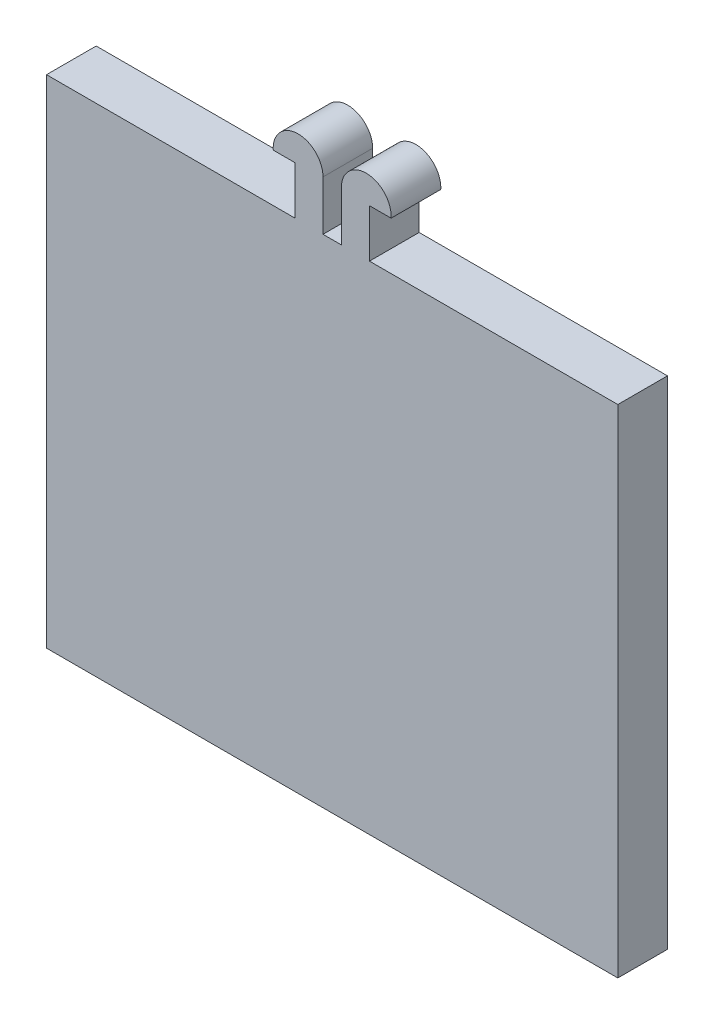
from build123d import *

# Parameters (mm, degrees)
BOSS_EXTRUDE1_DEPTH = 3


with BuildPart() as part:
    # Sketch1 → Boss-Extrude1 (new body)
    with BuildSketch(Plane.XY):
        with BuildLine():
            Line((17.254, -15), (-17.254, -15))
            Line((-17.254, -15), (-17.254, 15))
            Line((-17.254, 15), (-2.254, 15))
            Line((-2.254, 15), (-2.254, 17.9))
            Line((-2.254, 17.9), (-3.55867185, 17.9))
            ThreePointArc((-3.55867185, 17.9), (-2.108027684, 19.503167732), (-0.554, 18))
            Line((-0.554, 18), (-0.554, 15))
            Line((-0.554, 15), (0.554, 15))
            Line((0.554, 15), (0.554, 18))
            ThreePointArc((0.554, 18), (2.108027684, 19.503167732), (3.55867185, 17.9))
            Line((3.55867185, 17.9), (2.254, 17.9))
            Line((2.254, 17.9), (2.254, 15))
            Line((2.254, 15), (17.254, 15))
            Line((17.254, 15), (17.254, -15))
        make_face()
    extrude(amount=BOSS_EXTRUDE1_DEPTH)


solid = part.part
